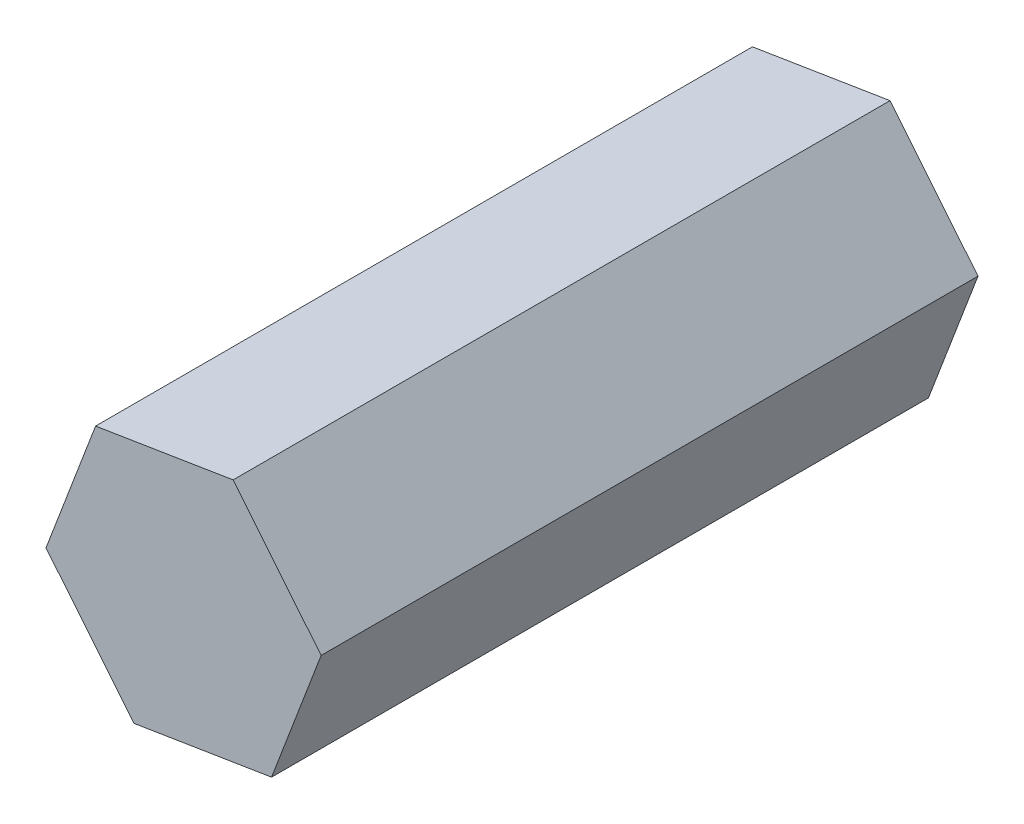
ISO-10303-21;
HEADER;
FILE_DESCRIPTION(('STEP AP214'),'2;1');
FILE_NAME('part.step','',(''),(''),'','','');
FILE_SCHEMA(('AUTOMOTIVE_DESIGN { 1 0 10303 214 1 1 1 1 }'));
ENDSEC;
DATA;
#1=APPLICATION_CONTEXT('core data for automotive mechanical design processes');
#2=APPLICATION_PROTOCOL_DEFINITION('international standard','automotive_design',2000,#1);
#3=PRODUCT_CONTEXT('',#1,'mechanical');
#4=PRODUCT('Part','Part','',(#3));
#5=PRODUCT_RELATED_PRODUCT_CATEGORY('part','',(#4));
#6=PRODUCT_DEFINITION_FORMATION('','',#4);
#7=PRODUCT_DEFINITION_CONTEXT('part definition',#1,'design');
#8=PRODUCT_DEFINITION('design','',#6,#7);
#9=PRODUCT_DEFINITION_SHAPE('','',#8);
#10=(LENGTH_UNIT() NAMED_UNIT(*) SI_UNIT(.MILLI.,.METRE.));
#11=(NAMED_UNIT(*) PLANE_ANGLE_UNIT() SI_UNIT($,.RADIAN.));
#12=(NAMED_UNIT(*) SI_UNIT($,.STERADIAN.) SOLID_ANGLE_UNIT());
#13=UNCERTAINTY_MEASURE_WITH_UNIT(LENGTH_MEASURE(1.E-05),#10,'distance_accuracy_value','');
#14=(GEOMETRIC_REPRESENTATION_CONTEXT(3) GLOBAL_UNCERTAINTY_ASSIGNED_CONTEXT((#13)) GLOBAL_UNIT_ASSIGNED_CONTEXT((#10,
#11,#12)) REPRESENTATION_CONTEXT('',''));
#15=CARTESIAN_POINT('',(0.,0.,0.));
#16=DIRECTION('',(0.,0.,1.));
#17=DIRECTION('',(1.,0.,0.));
#18=AXIS2_PLACEMENT_3D('',#15,#16,#17);
#19=CARTESIAN_POINT('',(-10.5658674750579,-27.7544978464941,140.));
#20=DIRECTION('',(-0.159168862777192,0.987251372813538,0.));
#21=DIRECTION('',(-0.987251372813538,-0.159168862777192,0.));
#22=AXIS2_PLACEMENT_3D('',#19,#20,#21);
#23=PLANE('',#22);
#24=DIRECTION('',(0.987251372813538,0.159168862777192,0.));
#25=VECTOR('',#24,1.);
#26=CARTESIAN_POINT('',(-10.5658674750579,-27.7544978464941,0.));
#27=LINE('',#26,#25);
#28=CARTESIAN_POINT('',(-10.5658674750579,-27.7544978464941,0.));
#29=VERTEX_POINT('',#28);
#30=CARTESIAN_POINT('',(18.7531664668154,-23.0275585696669,0.));
#31=VERTEX_POINT('',#30);
#32=EDGE_CURVE('E120',#29,#31,#27,.T.);
#33=ORIENTED_EDGE('',*,*,#32,.T.);
#34=DIRECTION('',(0.,0.,-1.));
#35=VECTOR('',#34,1.);
#36=CARTESIAN_POINT('',(18.7531664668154,-23.0275585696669,140.));
#37=LINE('',#36,#35);
#38=CARTESIAN_POINT('',(18.7531664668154,-23.0275585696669,140.));
#39=VERTEX_POINT('',#38);
#40=EDGE_CURVE('E11',#39,#31,#37,.T.);
#41=ORIENTED_EDGE('',*,*,#40,.F.);
#42=DIRECTION('',(0.987251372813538,0.159168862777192,0.));
#43=VECTOR('',#42,1.);
#44=CARTESIAN_POINT('',(-10.5658674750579,-27.7544978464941,140.));
#45=LINE('',#44,#43);
#46=CARTESIAN_POINT('',(-10.5658674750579,-27.7544978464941,140.));
#47=VERTEX_POINT('',#46);
#48=EDGE_CURVE('E130',#47,#39,#45,.T.);
#49=ORIENTED_EDGE('',*,*,#48,.F.);
#50=DIRECTION('',(0.,0.,-1.));
#51=VECTOR('',#50,1.);
#52=CARTESIAN_POINT('',(-10.5658674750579,-27.7544978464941,140.));
#53=LINE('',#52,#51);
#54=EDGE_CURVE('E116',#47,#29,#53,.T.);
#55=ORIENTED_EDGE('',*,*,#54,.T.);
#56=EDGE_LOOP('',(#33,#41,#49,#55));
#57=FACE_BOUND('',#56,.T.);
#58=ADVANCED_FACE('F36',(#57),#23,.F.);
#59=CARTESIAN_POINT('',(18.7531664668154,-23.0275585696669,140.));
#60=DIRECTION('',(-0.934569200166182,0.355781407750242,0.));
#61=DIRECTION('',(-0.355781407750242,-0.934569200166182,0.));
#62=AXIS2_PLACEMENT_3D('',#59,#60,#61);
#63=PLANE('',#62);
#64=DIRECTION('',(0.355781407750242,0.934569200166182,0.));
#65=VECTOR('',#64,1.);
#66=CARTESIAN_POINT('',(18.7531664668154,-23.0275585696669,0.));
#67=LINE('',#66,#65);
#68=CARTESIAN_POINT('',(29.3190339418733,4.72693927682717,0.));
#69=VERTEX_POINT('',#68);
#70=EDGE_CURVE('E123',#31,#69,#67,.T.);
#71=ORIENTED_EDGE('',*,*,#70,.T.);
#72=DIRECTION('',(0.,0.,-1.));
#73=VECTOR('',#72,1.);
#74=CARTESIAN_POINT('',(29.3190339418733,4.72693927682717,140.));
#75=LINE('',#74,#73);
#76=CARTESIAN_POINT('',(29.3190339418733,4.72693927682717,140.));
#77=VERTEX_POINT('',#76);
#78=EDGE_CURVE('E44',#77,#69,#75,.T.);
#79=ORIENTED_EDGE('',*,*,#78,.F.);
#80=DIRECTION('',(0.355781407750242,0.934569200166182,0.));
#81=VECTOR('',#80,1.);
#82=CARTESIAN_POINT('',(18.7531664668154,-23.0275585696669,140.));
#83=LINE('',#82,#81);
#84=EDGE_CURVE('E89',#39,#77,#83,.T.);
#85=ORIENTED_EDGE('',*,*,#84,.F.);
#86=ORIENTED_EDGE('',*,*,#40,.T.);
#87=EDGE_LOOP('',(#71,#79,#85,#86));
#88=FACE_BOUND('',#87,.T.);
#89=ADVANCED_FACE('F154',(#88),#63,.F.);
#90=CARTESIAN_POINT('',(29.3190339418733,4.72693927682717,140.));
#91=DIRECTION('',(-0.77540033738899,-0.631469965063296,0.));
#92=DIRECTION('',(0.631469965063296,-0.77540033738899,0.));
#93=AXIS2_PLACEMENT_3D('',#90,#91,#92);
#94=PLANE('',#93);
#95=DIRECTION('',(-0.631469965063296,0.77540033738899,0.));
#96=VECTOR('',#95,1.);
#97=CARTESIAN_POINT('',(29.3190339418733,4.72693927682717,0.));
#98=LINE('',#97,#96);
#99=CARTESIAN_POINT('',(10.5658674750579,27.7544978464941,0.));
#100=VERTEX_POINT('',#99);
#101=EDGE_CURVE('E125',#69,#100,#98,.T.);
#102=ORIENTED_EDGE('',*,*,#101,.T.);
#103=DIRECTION('',(0.,0.,-1.));
#104=VECTOR('',#103,1.);
#105=CARTESIAN_POINT('',(10.5658674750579,27.7544978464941,140.));
#106=LINE('',#105,#104);
#107=CARTESIAN_POINT('',(10.5658674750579,27.7544978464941,140.));
#108=VERTEX_POINT('',#107);
#109=EDGE_CURVE('E111',#108,#100,#106,.T.);
#110=ORIENTED_EDGE('',*,*,#109,.F.);
#111=DIRECTION('',(-0.631469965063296,0.77540033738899,0.));
#112=VECTOR('',#111,1.);
#113=CARTESIAN_POINT('',(29.3190339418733,4.72693927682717,140.));
#114=LINE('',#113,#112);
#115=EDGE_CURVE('E102',#77,#108,#114,.T.);
#116=ORIENTED_EDGE('',*,*,#115,.F.);
#117=ORIENTED_EDGE('',*,*,#78,.T.);
#118=EDGE_LOOP('',(#102,#110,#116,#117));
#119=FACE_BOUND('',#118,.T.);
#120=ADVANCED_FACE('F136',(#119),#94,.F.);
#121=CARTESIAN_POINT('',(10.5658674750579,27.7544978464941,140.));
#122=DIRECTION('',(0.159168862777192,-0.987251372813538,0.));
#123=DIRECTION('',(0.987251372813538,0.159168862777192,0.));
#124=AXIS2_PLACEMENT_3D('',#121,#122,#123);
#125=PLANE('',#124);
#126=DIRECTION('',(-0.987251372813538,-0.159168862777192,0.));
#127=VECTOR('',#126,1.);
#128=CARTESIAN_POINT('',(10.5658674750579,27.7544978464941,0.));
#129=LINE('',#128,#127);
#130=CARTESIAN_POINT('',(-18.7531664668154,23.0275585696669,0.));
#131=VERTEX_POINT('',#130);
#132=EDGE_CURVE('E110',#100,#131,#129,.T.);
#133=ORIENTED_EDGE('',*,*,#132,.T.);
#134=DIRECTION('',(0.,0.,-1.));
#135=VECTOR('',#134,1.);
#136=CARTESIAN_POINT('',(-18.7531664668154,23.0275585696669,140.));
#137=LINE('',#136,#135);
#138=CARTESIAN_POINT('',(-18.7531664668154,23.0275585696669,140.));
#139=VERTEX_POINT('',#138);
#140=EDGE_CURVE('E107',#139,#131,#137,.T.);
#141=ORIENTED_EDGE('',*,*,#140,.F.);
#142=DIRECTION('',(-0.987251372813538,-0.159168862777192,0.));
#143=VECTOR('',#142,1.);
#144=CARTESIAN_POINT('',(10.5658674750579,27.7544978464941,140.));
#145=LINE('',#144,#143);
#146=EDGE_CURVE('E96',#108,#139,#145,.T.);
#147=ORIENTED_EDGE('',*,*,#146,.F.);
#148=ORIENTED_EDGE('',*,*,#109,.T.);
#149=EDGE_LOOP('',(#133,#141,#147,#148));
#150=FACE_BOUND('',#149,.T.);
#151=ADVANCED_FACE('F108',(#150),#125,.F.);
#152=CARTESIAN_POINT('',(-18.7531664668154,23.0275585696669,140.));
#153=DIRECTION('',(0.934569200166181,-0.355781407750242,0.));
#154=DIRECTION('',(0.355781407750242,0.934569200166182,0.));
#155=AXIS2_PLACEMENT_3D('',#152,#153,#154);
#156=PLANE('',#155);
#157=DIRECTION('',(-0.355781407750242,-0.934569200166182,0.));
#158=VECTOR('',#157,1.);
#159=CARTESIAN_POINT('',(-18.7531664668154,23.0275585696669,0.));
#160=LINE('',#159,#158);
#161=CARTESIAN_POINT('',(-29.3190339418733,-4.72693927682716,0.));
#162=VERTEX_POINT('',#161);
#163=EDGE_CURVE('E75',#131,#162,#160,.T.);
#164=ORIENTED_EDGE('',*,*,#163,.T.);
#165=DIRECTION('',(0.,0.,-1.));
#166=VECTOR('',#165,1.);
#167=CARTESIAN_POINT('',(-29.3190339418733,-4.72693927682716,140.));
#168=LINE('',#167,#166);
#169=CARTESIAN_POINT('',(-29.3190339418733,-4.72693927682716,140.));
#170=VERTEX_POINT('',#169);
#171=EDGE_CURVE('E112',#170,#162,#168,.T.);
#172=ORIENTED_EDGE('',*,*,#171,.F.);
#173=DIRECTION('',(-0.355781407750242,-0.934569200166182,0.));
#174=VECTOR('',#173,1.);
#175=CARTESIAN_POINT('',(-18.7531664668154,23.0275585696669,140.));
#176=LINE('',#175,#174);
#177=EDGE_CURVE('E100',#139,#170,#176,.T.);
#178=ORIENTED_EDGE('',*,*,#177,.F.);
#179=ORIENTED_EDGE('',*,*,#140,.T.);
#180=EDGE_LOOP('',(#164,#172,#178,#179));
#181=FACE_BOUND('',#180,.T.);
#182=ADVANCED_FACE('F114',(#181),#156,.F.);
#183=CARTESIAN_POINT('',(-29.3190339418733,-4.72693927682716,140.));
#184=DIRECTION('',(0.77540033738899,0.631469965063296,0.));
#185=DIRECTION('',(-0.631469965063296,0.77540033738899,0.));
#186=AXIS2_PLACEMENT_3D('',#183,#184,#185);
#187=PLANE('',#186);
#188=DIRECTION('',(0.631469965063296,-0.77540033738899,0.));
#189=VECTOR('',#188,1.);
#190=CARTESIAN_POINT('',(-29.3190339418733,-4.72693927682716,0.));
#191=LINE('',#190,#189);
#192=EDGE_CURVE('E81',#162,#29,#191,.T.);
#193=ORIENTED_EDGE('',*,*,#192,.T.);
#194=ORIENTED_EDGE('',*,*,#54,.F.);
#195=DIRECTION('',(0.631469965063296,-0.77540033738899,0.));
#196=VECTOR('',#195,1.);
#197=CARTESIAN_POINT('',(-29.3190339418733,-4.72693927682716,140.));
#198=LINE('',#197,#196);
#199=EDGE_CURVE('E52',#170,#47,#198,.T.);
#200=ORIENTED_EDGE('',*,*,#199,.F.);
#201=ORIENTED_EDGE('',*,*,#171,.T.);
#202=EDGE_LOOP('',(#193,#194,#200,#201));
#203=FACE_BOUND('',#202,.T.);
#204=ADVANCED_FACE('F143',(#203),#187,.F.);
#205=CARTESIAN_POINT('',(0.,0.,140.));
#206=DIRECTION('',(0.,0.,1.));
#207=DIRECTION('',(1.,0.,0.));
#208=AXIS2_PLACEMENT_3D('',#205,#206,#207);
#209=PLANE('',#208);
#210=ORIENTED_EDGE('',*,*,#48,.T.);
#211=ORIENTED_EDGE('',*,*,#84,.T.);
#212=ORIENTED_EDGE('',*,*,#115,.T.);
#213=ORIENTED_EDGE('',*,*,#146,.T.);
#214=ORIENTED_EDGE('',*,*,#177,.T.);
#215=ORIENTED_EDGE('',*,*,#199,.T.);
#216=EDGE_LOOP('',(#210,#211,#212,#213,#214,#215));
#217=FACE_BOUND('',#216,.T.);
#218=ADVANCED_FACE('F98',(#217),#209,.T.);
#219=CARTESIAN_POINT('',(0.,0.,0.));
#220=DIRECTION('',(0.,0.,1.));
#221=DIRECTION('',(1.,0.,0.));
#222=AXIS2_PLACEMENT_3D('',#219,#220,#221);
#223=PLANE('',#222);
#224=ORIENTED_EDGE('',*,*,#32,.F.);
#225=ORIENTED_EDGE('',*,*,#192,.F.);
#226=ORIENTED_EDGE('',*,*,#163,.F.);
#227=ORIENTED_EDGE('',*,*,#132,.F.);
#228=ORIENTED_EDGE('',*,*,#101,.F.);
#229=ORIENTED_EDGE('',*,*,#70,.F.);
#230=EDGE_LOOP('',(#224,#225,#226,#227,#228,#229));
#231=FACE_BOUND('',#230,.T.);
#232=ADVANCED_FACE('F139',(#231),#223,.F.);
#233=CLOSED_SHELL('',(#58,#89,#120,#151,#182,#204,#218,#232));
#234=MANIFOLD_SOLID_BREP('B2',#233);
#235=ADVANCED_BREP_SHAPE_REPRESENTATION('',(#18,#234),#14);
#236=SHAPE_DEFINITION_REPRESENTATION(#9,#235);
ENDSEC;
END-ISO-10303-21;
